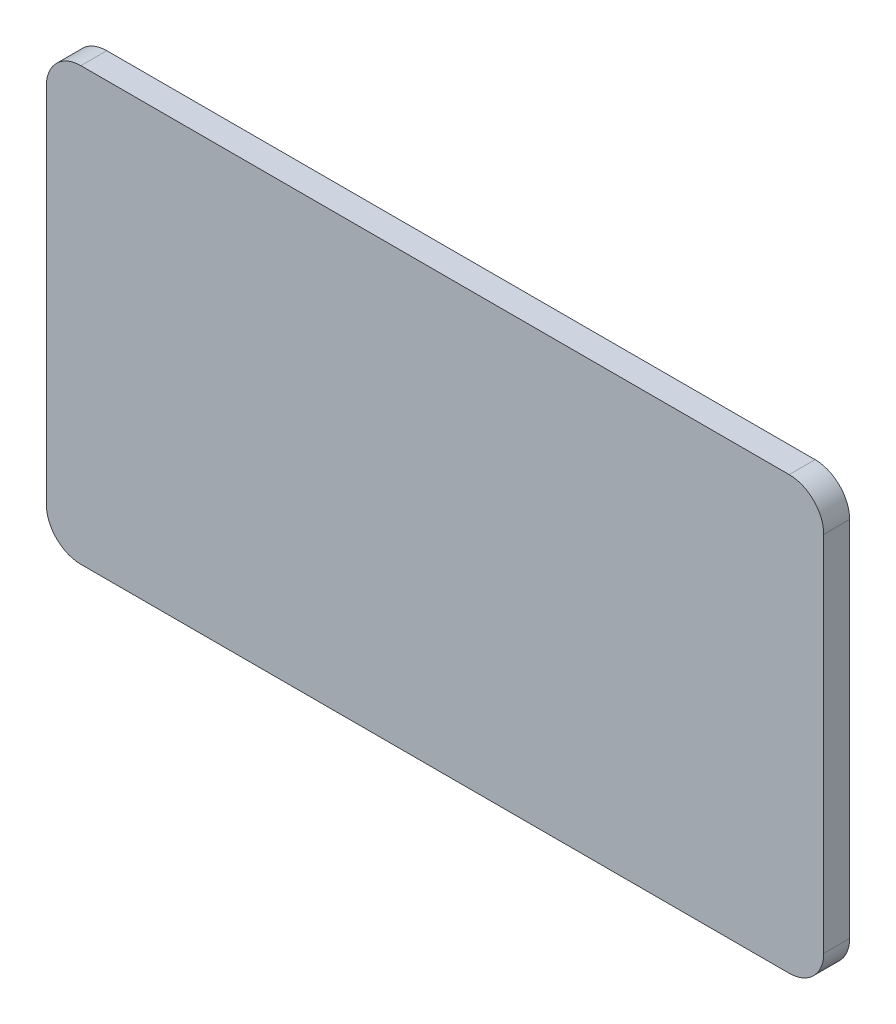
ISO-10303-21;
HEADER;
FILE_DESCRIPTION(('STEP AP214'),'2;1');
FILE_NAME('part.step','',(''),(''),'','','');
FILE_SCHEMA(('AUTOMOTIVE_DESIGN { 1 0 10303 214 1 1 1 1 }'));
ENDSEC;
DATA;
#1=APPLICATION_CONTEXT('core data for automotive mechanical design processes');
#2=APPLICATION_PROTOCOL_DEFINITION('international standard','automotive_design',2000,#1);
#3=PRODUCT_CONTEXT('',#1,'mechanical');
#4=PRODUCT('Part','Part','',(#3));
#5=PRODUCT_RELATED_PRODUCT_CATEGORY('part','',(#4));
#6=PRODUCT_DEFINITION_FORMATION('','',#4);
#7=PRODUCT_DEFINITION_CONTEXT('part definition',#1,'design');
#8=PRODUCT_DEFINITION('design','',#6,#7);
#9=PRODUCT_DEFINITION_SHAPE('','',#8);
#10=(LENGTH_UNIT() NAMED_UNIT(*) SI_UNIT(.MILLI.,.METRE.));
#11=(NAMED_UNIT(*) PLANE_ANGLE_UNIT() SI_UNIT($,.RADIAN.));
#12=(NAMED_UNIT(*) SI_UNIT($,.STERADIAN.) SOLID_ANGLE_UNIT());
#13=UNCERTAINTY_MEASURE_WITH_UNIT(LENGTH_MEASURE(1.E-05),#10,'distance_accuracy_value','');
#14=(GEOMETRIC_REPRESENTATION_CONTEXT(3) GLOBAL_UNCERTAINTY_ASSIGNED_CONTEXT((#13)) GLOBAL_UNIT_ASSIGNED_CONTEXT((#10,
#11,#12)) REPRESENTATION_CONTEXT('',''));
#15=CARTESIAN_POINT('',(0.,0.,0.));
#16=DIRECTION('',(0.,0.,1.));
#17=DIRECTION('',(1.,0.,0.));
#18=AXIS2_PLACEMENT_3D('',#15,#16,#17);
#19=CARTESIAN_POINT('',(-115.57,-11.43,3.81));
#20=DIRECTION('',(0.,0.,-1.));
#21=DIRECTION('',(-1.,0.,0.));
#22=AXIS2_PLACEMENT_3D('',#19,#20,#21);
#23=CYLINDRICAL_SURFACE('',#22,5.08);
#24=CARTESIAN_POINT('',(-115.57,-11.43,0.));
#25=DIRECTION('',(0.,0.,1.));
#26=DIRECTION('',(1.,0.,0.));
#27=AXIS2_PLACEMENT_3D('',#24,#25,#26);
#28=CIRCLE('',#27,5.08);
#29=CARTESIAN_POINT('',(-115.57,-6.35,0.));
#30=VERTEX_POINT('',#29);
#31=CARTESIAN_POINT('',(-120.65,-11.43,0.));
#32=VERTEX_POINT('',#31);
#33=EDGE_CURVE('E97',#30,#32,#28,.T.);
#34=ORIENTED_EDGE('',*,*,#33,.T.);
#35=DIRECTION('',(0.,0.,-1.));
#36=VECTOR('',#35,1.);
#37=CARTESIAN_POINT('',(-120.65,-11.43,3.81));
#38=LINE('',#37,#36);
#39=CARTESIAN_POINT('',(-120.65,-11.43,3.81));
#40=VERTEX_POINT('',#39);
#41=EDGE_CURVE('E11',#40,#32,#38,.T.);
#42=ORIENTED_EDGE('',*,*,#41,.F.);
#43=CARTESIAN_POINT('',(-115.57,-11.43,3.81));
#44=DIRECTION('',(0.,0.,1.));
#45=DIRECTION('',(1.,0.,0.));
#46=AXIS2_PLACEMENT_3D('',#43,#44,#45);
#47=CIRCLE('',#46,5.08);
#48=CARTESIAN_POINT('',(-115.57,-6.35,3.81));
#49=VERTEX_POINT('',#48);
#50=EDGE_CURVE('E124',#49,#40,#47,.T.);
#51=ORIENTED_EDGE('',*,*,#50,.F.);
#52=DIRECTION('',(0.,0.,-1.));
#53=VECTOR('',#52,1.);
#54=CARTESIAN_POINT('',(-115.57,-6.35,3.81));
#55=LINE('',#54,#53);
#56=EDGE_CURVE('E110',#49,#30,#55,.T.);
#57=ORIENTED_EDGE('',*,*,#56,.T.);
#58=EDGE_LOOP('',(#34,#42,#51,#57));
#59=FACE_BOUND('',#58,.T.);
#60=ADVANCED_FACE('F29',(#59),#23,.T.);
#61=CARTESIAN_POINT('',(-120.65,-11.43,3.81));
#62=DIRECTION('',(1.,0.,0.));
#63=DIRECTION('',(0.,0.,-1.));
#64=AXIS2_PLACEMENT_3D('',#61,#62,#63);
#65=PLANE('',#64);
#66=DIRECTION('',(0.,-1.,0.));
#67=VECTOR('',#66,1.);
#68=CARTESIAN_POINT('',(-120.65,-11.43,0.));
#69=LINE('',#68,#67);
#70=CARTESIAN_POINT('',(-120.65,-64.77,0.));
#71=VERTEX_POINT('',#70);
#72=EDGE_CURVE('E93',#32,#71,#69,.T.);
#73=ORIENTED_EDGE('',*,*,#72,.T.);
#74=DIRECTION('',(0.,0.,-1.));
#75=VECTOR('',#74,1.);
#76=CARTESIAN_POINT('',(-120.65,-64.77,3.81));
#77=LINE('',#76,#75);
#78=CARTESIAN_POINT('',(-120.65,-64.77,3.81));
#79=VERTEX_POINT('',#78);
#80=EDGE_CURVE('E36',#79,#71,#77,.T.);
#81=ORIENTED_EDGE('',*,*,#80,.F.);
#82=DIRECTION('',(0.,-1.,0.));
#83=VECTOR('',#82,1.);
#84=CARTESIAN_POINT('',(-120.65,-11.43,3.81));
#85=LINE('',#84,#83);
#86=EDGE_CURVE('E106',#40,#79,#85,.T.);
#87=ORIENTED_EDGE('',*,*,#86,.F.);
#88=ORIENTED_EDGE('',*,*,#41,.T.);
#89=EDGE_LOOP('',(#73,#81,#87,#88));
#90=FACE_BOUND('',#89,.T.);
#91=ADVANCED_FACE('F105',(#90),#65,.F.);
#92=CARTESIAN_POINT('',(-115.57,-64.77,3.81));
#93=DIRECTION('',(0.,0.,-1.));
#94=DIRECTION('',(-1.,0.,0.));
#95=AXIS2_PLACEMENT_3D('',#92,#93,#94);
#96=CYLINDRICAL_SURFACE('',#95,5.07999999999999);
#97=CARTESIAN_POINT('',(-115.57,-64.77,0.));
#98=DIRECTION('',(0.,0.,1.));
#99=DIRECTION('',(1.,0.,0.));
#100=AXIS2_PLACEMENT_3D('',#97,#98,#99);
#101=CIRCLE('',#100,5.07999999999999);
#102=CARTESIAN_POINT('',(-115.57,-69.85,0.));
#103=VERTEX_POINT('',#102);
#104=EDGE_CURVE('E99',#71,#103,#101,.T.);
#105=ORIENTED_EDGE('',*,*,#104,.T.);
#106=DIRECTION('',(0.,0.,-1.));
#107=VECTOR('',#106,1.);
#108=CARTESIAN_POINT('',(-115.57,-69.85,3.81));
#109=LINE('',#108,#107);
#110=CARTESIAN_POINT('',(-115.57,-69.85,3.81));
#111=VERTEX_POINT('',#110);
#112=EDGE_CURVE('E150',#111,#103,#109,.T.);
#113=ORIENTED_EDGE('',*,*,#112,.F.);
#114=CARTESIAN_POINT('',(-115.57,-64.77,3.81));
#115=DIRECTION('',(0.,0.,1.));
#116=DIRECTION('',(1.,0.,0.));
#117=AXIS2_PLACEMENT_3D('',#114,#115,#116);
#118=CIRCLE('',#117,5.07999999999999);
#119=EDGE_CURVE('E127',#79,#111,#118,.T.);
#120=ORIENTED_EDGE('',*,*,#119,.F.);
#121=ORIENTED_EDGE('',*,*,#80,.T.);
#122=EDGE_LOOP('',(#105,#113,#120,#121));
#123=FACE_BOUND('',#122,.T.);
#124=ADVANCED_FACE('F154',(#123),#96,.T.);
#125=CARTESIAN_POINT('',(-115.57,-69.85,3.81));
#126=DIRECTION('',(0.,1.,0.));
#127=DIRECTION('',(-1.,0.,0.));
#128=AXIS2_PLACEMENT_3D('',#125,#126,#127);
#129=PLANE('',#128);
#130=DIRECTION('',(1.,0.,0.));
#131=VECTOR('',#130,1.);
#132=CARTESIAN_POINT('',(-115.57,-69.85,0.));
#133=LINE('',#132,#131);
#134=CARTESIAN_POINT('',(-11.43,-69.85,0.));
#135=VERTEX_POINT('',#134);
#136=EDGE_CURVE('E114',#103,#135,#133,.T.);
#137=ORIENTED_EDGE('',*,*,#136,.T.);
#138=DIRECTION('',(0.,0.,-1.));
#139=VECTOR('',#138,1.);
#140=CARTESIAN_POINT('',(-11.43,-69.85,3.81));
#141=LINE('',#140,#139);
#142=CARTESIAN_POINT('',(-11.43,-69.85,3.81));
#143=VERTEX_POINT('',#142);
#144=EDGE_CURVE('E147',#143,#135,#141,.T.);
#145=ORIENTED_EDGE('',*,*,#144,.F.);
#146=DIRECTION('',(1.,0.,0.));
#147=VECTOR('',#146,1.);
#148=CARTESIAN_POINT('',(-115.57,-69.85,3.81));
#149=LINE('',#148,#147);
#150=EDGE_CURVE('E129',#111,#143,#149,.T.);
#151=ORIENTED_EDGE('',*,*,#150,.F.);
#152=ORIENTED_EDGE('',*,*,#112,.T.);
#153=EDGE_LOOP('',(#137,#145,#151,#152));
#154=FACE_BOUND('',#153,.T.);
#155=ADVANCED_FACE('F162',(#154),#129,.F.);
#156=CARTESIAN_POINT('',(-11.43,-64.77,3.81));
#157=DIRECTION('',(0.,0.,-1.));
#158=DIRECTION('',(-1.,0.,0.));
#159=AXIS2_PLACEMENT_3D('',#156,#157,#158);
#160=CYLINDRICAL_SURFACE('',#159,5.08);
#161=CARTESIAN_POINT('',(-11.43,-64.77,0.));
#162=DIRECTION('',(0.,0.,1.));
#163=DIRECTION('',(1.,0.,0.));
#164=AXIS2_PLACEMENT_3D('',#161,#162,#163);
#165=CIRCLE('',#164,5.08);
#166=CARTESIAN_POINT('',(-6.35,-64.77,0.));
#167=VERTEX_POINT('',#166);
#168=EDGE_CURVE('E116',#135,#167,#165,.T.);
#169=ORIENTED_EDGE('',*,*,#168,.T.);
#170=DIRECTION('',(0.,0.,-1.));
#171=VECTOR('',#170,1.);
#172=CARTESIAN_POINT('',(-6.35,-64.77,3.81));
#173=LINE('',#172,#171);
#174=CARTESIAN_POINT('',(-6.35,-64.77,3.81));
#175=VERTEX_POINT('',#174);
#176=EDGE_CURVE('E144',#175,#167,#173,.T.);
#177=ORIENTED_EDGE('',*,*,#176,.F.);
#178=CARTESIAN_POINT('',(-11.43,-64.77,3.81));
#179=DIRECTION('',(0.,0.,1.));
#180=DIRECTION('',(1.,0.,0.));
#181=AXIS2_PLACEMENT_3D('',#178,#179,#180);
#182=CIRCLE('',#181,5.08);
#183=EDGE_CURVE('E131',#143,#175,#182,.T.);
#184=ORIENTED_EDGE('',*,*,#183,.F.);
#185=ORIENTED_EDGE('',*,*,#144,.T.);
#186=EDGE_LOOP('',(#169,#177,#184,#185));
#187=FACE_BOUND('',#186,.T.);
#188=ADVANCED_FACE('F165',(#187),#160,.T.);
#189=CARTESIAN_POINT('',(-6.35,-64.77,3.81));
#190=DIRECTION('',(-1.,0.,0.));
#191=DIRECTION('',(0.,-1.,0.));
#192=AXIS2_PLACEMENT_3D('',#189,#190,#191);
#193=PLANE('',#192);
#194=DIRECTION('',(0.,1.,0.));
#195=VECTOR('',#194,1.);
#196=CARTESIAN_POINT('',(-6.35,-64.77,0.));
#197=LINE('',#196,#195);
#198=CARTESIAN_POINT('',(-6.35,-11.43,0.));
#199=VERTEX_POINT('',#198);
#200=EDGE_CURVE('E118',#167,#199,#197,.T.);
#201=ORIENTED_EDGE('',*,*,#200,.T.);
#202=DIRECTION('',(0.,0.,-1.));
#203=VECTOR('',#202,1.);
#204=CARTESIAN_POINT('',(-6.35,-11.43,3.81));
#205=LINE('',#204,#203);
#206=CARTESIAN_POINT('',(-6.35,-11.43,3.81));
#207=VERTEX_POINT('',#206);
#208=EDGE_CURVE('E141',#207,#199,#205,.T.);
#209=ORIENTED_EDGE('',*,*,#208,.F.);
#210=DIRECTION('',(0.,1.,0.));
#211=VECTOR('',#210,1.);
#212=CARTESIAN_POINT('',(-6.35,-64.77,3.81));
#213=LINE('',#212,#211);
#214=EDGE_CURVE('E133',#175,#207,#213,.T.);
#215=ORIENTED_EDGE('',*,*,#214,.F.);
#216=ORIENTED_EDGE('',*,*,#176,.T.);
#217=EDGE_LOOP('',(#201,#209,#215,#216));
#218=FACE_BOUND('',#217,.T.);
#219=ADVANCED_FACE('F170',(#218),#193,.F.);
#220=CARTESIAN_POINT('',(-11.43,-11.43,3.81));
#221=DIRECTION('',(0.,0.,-1.));
#222=DIRECTION('',(-1.,0.,0.));
#223=AXIS2_PLACEMENT_3D('',#220,#221,#222);
#224=CYLINDRICAL_SURFACE('',#223,5.08);
#225=CARTESIAN_POINT('',(-11.43,-11.43,0.));
#226=DIRECTION('',(0.,0.,1.));
#227=DIRECTION('',(1.,0.,0.));
#228=AXIS2_PLACEMENT_3D('',#225,#226,#227);
#229=CIRCLE('',#228,5.08);
#230=CARTESIAN_POINT('',(-11.43,-6.35,0.));
#231=VERTEX_POINT('',#230);
#232=EDGE_CURVE('E120',#199,#231,#229,.T.);
#233=ORIENTED_EDGE('',*,*,#232,.T.);
#234=DIRECTION('',(0.,0.,-1.));
#235=VECTOR('',#234,1.);
#236=CARTESIAN_POINT('',(-11.43,-6.35,3.81));
#237=LINE('',#236,#235);
#238=CARTESIAN_POINT('',(-11.43,-6.35,3.81));
#239=VERTEX_POINT('',#238);
#240=EDGE_CURVE('E138',#239,#231,#237,.T.);
#241=ORIENTED_EDGE('',*,*,#240,.F.);
#242=CARTESIAN_POINT('',(-11.43,-11.43,3.81));
#243=DIRECTION('',(0.,0.,1.));
#244=DIRECTION('',(1.,0.,0.));
#245=AXIS2_PLACEMENT_3D('',#242,#243,#244);
#246=CIRCLE('',#245,5.08);
#247=EDGE_CURVE('E48',#207,#239,#246,.T.);
#248=ORIENTED_EDGE('',*,*,#247,.F.);
#249=ORIENTED_EDGE('',*,*,#208,.T.);
#250=EDGE_LOOP('',(#233,#241,#248,#249));
#251=FACE_BOUND('',#250,.T.);
#252=ADVANCED_FACE('F173',(#251),#224,.T.);
#253=CARTESIAN_POINT('',(-11.43,-6.35,3.81));
#254=DIRECTION('',(0.,-1.,0.));
#255=DIRECTION('',(1.,0.,0.));
#256=AXIS2_PLACEMENT_3D('',#253,#254,#255);
#257=PLANE('',#256);
#258=DIRECTION('',(-1.,0.,0.));
#259=VECTOR('',#258,1.);
#260=CARTESIAN_POINT('',(-11.43,-6.35,0.));
#261=LINE('',#260,#259);
#262=EDGE_CURVE('E122',#231,#30,#261,.T.);
#263=ORIENTED_EDGE('',*,*,#262,.T.);
#264=ORIENTED_EDGE('',*,*,#56,.F.);
#265=DIRECTION('',(-1.,0.,0.));
#266=VECTOR('',#265,1.);
#267=CARTESIAN_POINT('',(-11.43,-6.35,3.81));
#268=LINE('',#267,#266);
#269=EDGE_CURVE('E43',#239,#49,#268,.T.);
#270=ORIENTED_EDGE('',*,*,#269,.F.);
#271=ORIENTED_EDGE('',*,*,#240,.T.);
#272=EDGE_LOOP('',(#263,#264,#270,#271));
#273=FACE_BOUND('',#272,.T.);
#274=ADVANCED_FACE('F175',(#273),#257,.F.);
#275=CARTESIAN_POINT('',(-115.57,-11.43,3.81));
#276=DIRECTION('',(0.,0.,1.));
#277=DIRECTION('',(1.,0.,0.));
#278=AXIS2_PLACEMENT_3D('',#275,#276,#277);
#279=PLANE('',#278);
#280=ORIENTED_EDGE('',*,*,#50,.T.);
#281=ORIENTED_EDGE('',*,*,#86,.T.);
#282=ORIENTED_EDGE('',*,*,#119,.T.);
#283=ORIENTED_EDGE('',*,*,#150,.T.);
#284=ORIENTED_EDGE('',*,*,#183,.T.);
#285=ORIENTED_EDGE('',*,*,#214,.T.);
#286=ORIENTED_EDGE('',*,*,#247,.T.);
#287=ORIENTED_EDGE('',*,*,#269,.T.);
#288=EDGE_LOOP('',(#280,#281,#282,#283,#284,#285,#286,#287));
#289=FACE_BOUND('',#288,.T.);
#290=ADVANCED_FACE('F157',(#289),#279,.T.);
#291=CARTESIAN_POINT('',(-115.57,-11.43,0.));
#292=DIRECTION('',(0.,0.,1.));
#293=DIRECTION('',(1.,0.,0.));
#294=AXIS2_PLACEMENT_3D('',#291,#292,#293);
#295=PLANE('',#294);
#296=ORIENTED_EDGE('',*,*,#33,.F.);
#297=ORIENTED_EDGE('',*,*,#262,.F.);
#298=ORIENTED_EDGE('',*,*,#232,.F.);
#299=ORIENTED_EDGE('',*,*,#200,.F.);
#300=ORIENTED_EDGE('',*,*,#168,.F.);
#301=ORIENTED_EDGE('',*,*,#136,.F.);
#302=ORIENTED_EDGE('',*,*,#104,.F.);
#303=ORIENTED_EDGE('',*,*,#72,.F.);
#304=EDGE_LOOP('',(#296,#297,#298,#299,#300,#301,#302,#303));
#305=FACE_BOUND('',#304,.T.);
#306=ADVANCED_FACE('F94',(#305),#295,.F.);
#307=CLOSED_SHELL('',(#60,#91,#124,#155,#188,#219,#252,#274,#290,#306));
#308=MANIFOLD_SOLID_BREP('B2',#307);
#309=ADVANCED_BREP_SHAPE_REPRESENTATION('',(#18,#308),#14);
#310=SHAPE_DEFINITION_REPRESENTATION(#9,#309);
ENDSEC;
END-ISO-10303-21;
